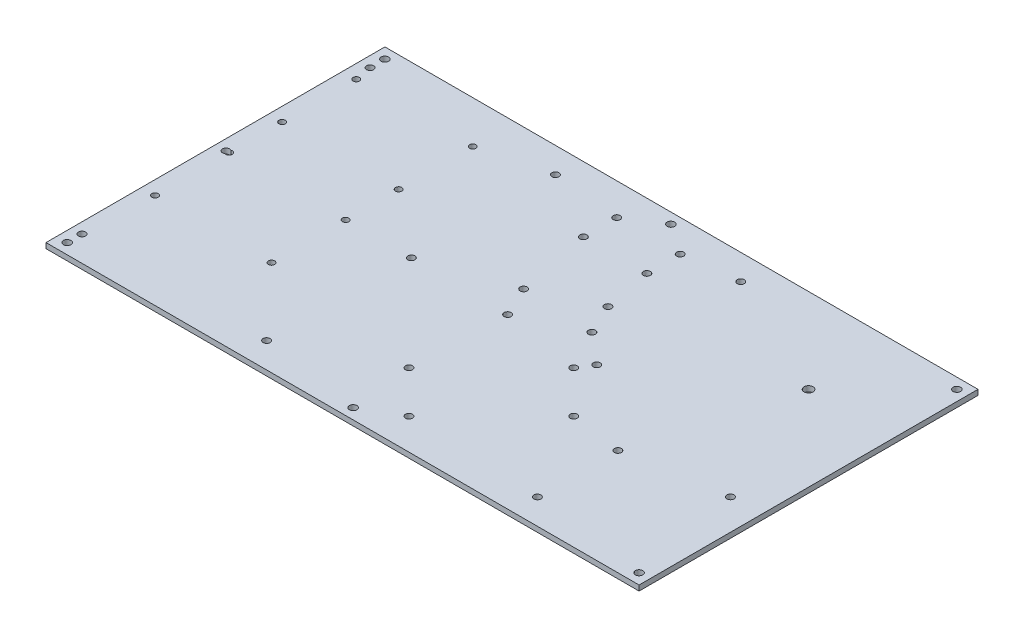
from build123d import *

# Parameters (mm, degrees)
SKETCH1_W                     = 355.6
SKETCH1_H                     = 203.2
BOSS_EXTRUDE1_DEPTH           = 3.175
F_8_CLEARANCE_HOLE1_D         = 4.4958
F_6_CLEARANCE_HOLE1_D         = 3.7973
HOLE_FOR_2_300_SC_NUTS_SP_1_D = 4.2164
HOLE_FOR_4_300_SC_NUTS_SP_1_D = 4.2164
HOLE_FOR_8_300_SC_NUTS_SP_1_D = 5.4102


with BuildPart() as part:
    # Sketch1 → Boss-Extrude1 (new body)
    with BuildSketch(Plane(origin=(0, 0, 0), x_dir=(1, 0, 0), z_dir=(0, 1, 0))):
        with Locations((177.8, 101.6)):
            Rectangle(SKETCH1_W, SKETCH1_H)
    extrude(amount=BOSS_EXTRUDE1_DEPTH)

    # 8 Clearance Hole1 (through all)
    with Locations(Plane(origin=(0, 3.175, 0), x_dir=(1, 0, 0), z_dir=(0, 1, 0))):
        with Locations((6.35, 196.85), (177.8, 196.85), (349.25, 196.85), (349.25, 6.35), (177.8, 6.35), (6.35, 6.35)):
            Hole(F_8_CLEARANCE_HOLE1_D / 2)

    # 6 Clearance Hole1 (through all)
    with Locations(Plane(origin=(0, 0, 0), x_dir=(-1, 0, 0), z_dir=(0, -1, 0))):
        with Locations((-8.204806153, 57.168273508), (-8.204806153, 101.618273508), (-78.054806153, 101.618273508), (-78.054806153, 57.168273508), (-8.204806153, 133.368273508), (-78.054806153, 133.368273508), (-78.054806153, 177.818273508), (-8.204806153, 177.818273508)):
            Hole(F_6_CLEARANCE_HOLE1_D / 2)

    # Hole for _2 300_ SC Nuts _SP_1 (through all)
    with Locations(Plane(origin=(0, 3.175, 0), x_dir=(1, 0, 0), z_dir=(0, 1, 0))):
        with Locations((173.824558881, 43.797047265), (223.215967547, 93.188455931), (248.360684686, 68.043738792), (198.96927602, 18.652330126), (337.269144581, 73.136632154)):
            Hole(HOLE_FOR_2_300_SC_NUTS_SP_1_D / 2)

    # Hole for _4 300_ SC Nuts _SP_1 (through all)
    with Locations(Plane(origin=(0, 3.175, 0), x_dir=(1, 0, 0), z_dir=(0, 1, 0))):
        with Locations((158.144890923, 164.062811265), (158.117742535, 184.062792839), (196.117707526, 184.114374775), (196.144855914, 164.114393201), (167.302257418, 119.108761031), (175.779219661, 100.994095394), (210.197084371, 117.100323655), (201.720122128, 135.214989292), (6.35, 187.96), (6.35, 101.6), (6.35, 15.24), (117.018728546, 15.24), (117.475, 101.6), (117.475, 187.96), (228.6, 187.96), (228.6, 101.6), (279.4, 63.5), (279.4, 15.24)):
            Hole(HOLE_FOR_4_300_SC_NUTS_SP_1_D / 2)

    # Hole for _8 300_ SC Nuts _SP_1 (through all)
    with Locations(Plane(origin=(0, 3.175, 0), x_dir=(1, 0, 0), z_dir=(0, 1, 0))):
        with Locations((304.8, 152.4)):
            Hole(HOLE_FOR_8_300_SC_NUTS_SP_1_D / 2)


solid = part.part
